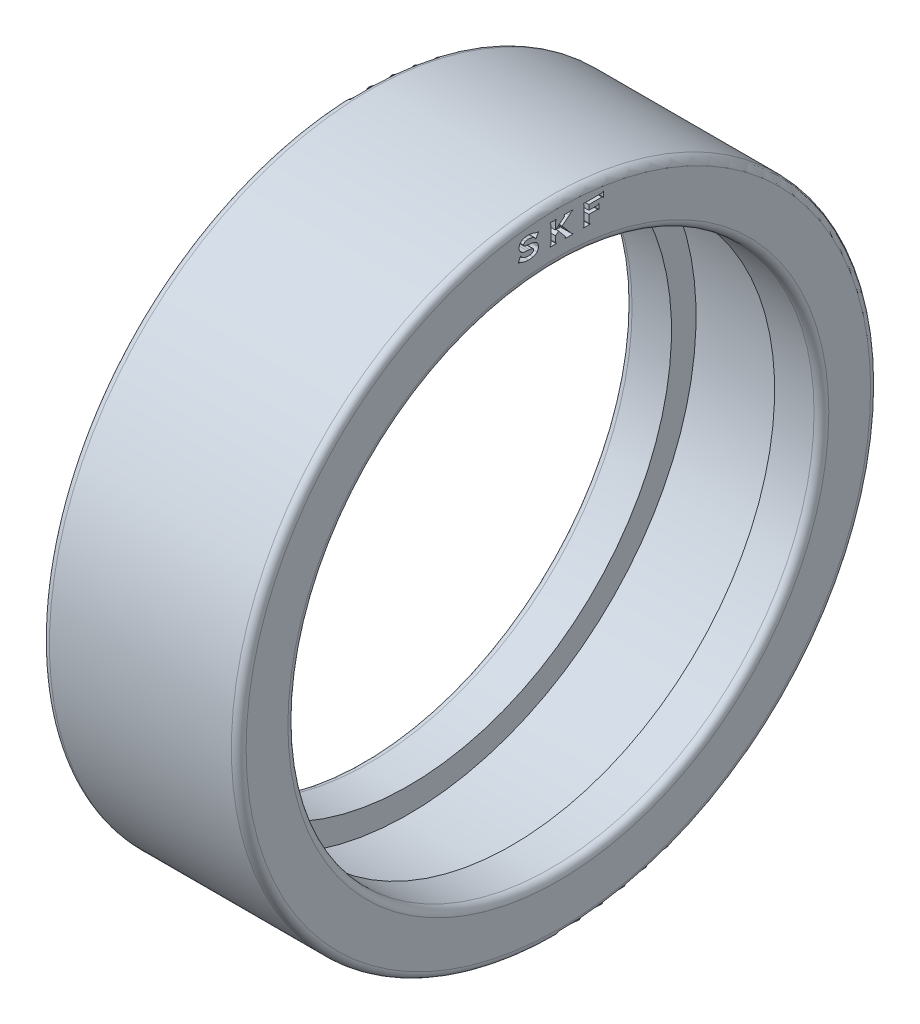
from build123d import *

# Parameters (mm, degrees)
CONG_1_R                = 0.3
ENL_V_MAT_EXTRU_1_DEPTH = 0.5
ENL_V_MAT_EXTRU_2_DEPTH = 0.5


with BuildPart() as part:
    # Esquisse1 → Base-R_volution (revolve)
    with BuildSketch(Plane.XY, mode=Mode.PRIVATE) as base_r_volution_sk:
        Polygon((0, 13), (8, 13), (8, 10.7), (6.097617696, 10.7), (6.097617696, 11.699280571), (1.902382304, 11.699280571), (1.902382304, 10.7), (0, 10.7), align=None)
    revolve(base_r_volution_sk.sketch.rotate(Axis((-1.3, 0, 0), (1, 0, 0)), 270), axis=Axis((-1.3, 0, 0), (1, 0, 0)))

    # Cong_1
    cong_1_edges = [part.edges().sort_by_distance(p)[0] for p in [
        (0, 0, 13),
        (8, 0, 13),
        (8, 0, 10.7),
        (0, 0, 10.7),
    ]]
    fillet(cong_1_edges, radius=CONG_1_R)

    # Esquisse2 → Enl_v. mat.-Extru.1 (cut)
    with BuildSketch(Plane.ZY):
        with BuildLine():
            Line((-0.854784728, 12.276830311), (-0.958073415, 12.074196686))
            Line((-0.958073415, 12.074196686), (-0.975726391, 12.084337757))
            add(Edge.make_bspline(
                [(-0.975726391, 12.084337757), (-0.975589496, 12.086277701), (-0.975351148, 12.089655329), (-0.975219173, 12.0930387), (-0.975162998, 12.094478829)],
                knots=[0, 0, 0, 0, 1.148701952, 2, 2, 2, 2], degree=3))
            add(Edge.make_bspline(
                [(-0.975162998, 12.094478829), (-0.975644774, 12.098268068), (-0.976690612, 12.106493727), (-0.98480233, 12.117973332), (-0.99638937, 12.129902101), (-1.006432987, 12.13696832), (-1.01197133, 12.140864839)],
                knots=[0, 0, 0, 0, 0.73831218, 1.60272366, 2.678072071, 4, 4, 4, 4], degree=3))
            add(Edge.make_bspline(
                [(-1.01197133, 12.140864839), (-1.021447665, 12.147165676), (-1.040373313, 12.159749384), (-1.070604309, 12.175655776), (-1.101961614, 12.189131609), (-1.134483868, 12.200426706), (-1.168354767, 12.208669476), (-1.203389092, 12.21501772), (-1.239698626, 12.218520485), (-1.264301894, 12.219080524), (-1.276765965, 12.219364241)],
                knots=[0, 0, 0, 0, 0.972885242, 1.942996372, 2.916765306, 3.890416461, 4.883889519, 5.895380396, 6.933794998, 8, 8, 8, 8], degree=3))
            add(Edge.make_bspline(
                [(-1.276765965, 12.219364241), (-1.287106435, 12.219236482), (-1.307214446, 12.218988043), (-1.336369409, 12.215558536), (-1.363812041, 12.210845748), (-1.381039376, 12.205463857), (-1.389444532, 12.202838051)],
                knots=[0, 0, 0, 0, 1.084209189, 2.108346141, 3.077068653, 4, 4, 4, 4], degree=3))
            add(Edge.make_bspline(
                [(-1.389444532, 12.202838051), (-1.39513336, 12.200582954), (-1.406297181, 12.196157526), (-1.421802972, 12.18753659), (-1.435436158, 12.177067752), (-1.447205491, 12.16534533), (-1.456928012, 12.152590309), (-1.463927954, 12.139005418), (-1.468388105, 12.124740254), (-1.468842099, 12.114980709), (-1.46907072, 12.11006603)],
                knots=[0, 0, 0, 0, 1.127971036, 2.213543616, 3.259654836, 4.288353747, 5.269766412, 6.204424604, 7.095790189, 8, 8, 8, 8], degree=3))
            add(Edge.make_bspline(
                [(-1.46907072, 12.11006603), (-1.468879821, 12.106170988), (-1.468505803, 12.098539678), (-1.46588921, 12.087557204), (-1.461334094, 12.077567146), (-1.454687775, 12.068744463), (-1.446345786, 12.060863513), (-1.436264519, 12.05381967), (-1.424295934, 12.04805032), (-1.415584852, 12.045116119), (-1.411041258, 12.043585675)],
                knots=[0, 0, 0, 0, 0.978451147, 1.917017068, 2.81791731, 3.717718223, 4.674561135, 5.691334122, 6.795827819, 8, 8, 8, 8], degree=3))
            add(Edge.make_bspline(
                [(-1.411041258, 12.043585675), (-1.408231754, 12.042804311), (-1.401908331, 12.041045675), (-1.391170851, 12.038876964), (-1.378247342, 12.036719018), (-1.363257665, 12.03415854), (-1.346125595, 12.032063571), (-1.326913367, 12.029587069), (-1.30552739, 12.026869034), (-1.290479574, 12.025392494), (-1.282587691, 12.024618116)],
                knots=[0, 0, 0, 0, 0.538375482, 1.211735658, 2.021344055, 2.958269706, 4.019330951, 5.207982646, 6.535715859, 8, 8, 8, 8], degree=3))
            Line((-1.282587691, 12.024618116), (-1.184745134, 12.014477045))
            add(Edge.make_bspline(
                [(-1.184745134, 12.014477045), (-1.170897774, 12.012888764), (-1.144453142, 12.009855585), (-1.107024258, 12.003952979), (-1.073764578, 11.99696577), (-1.044162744, 11.989314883), (-1.017378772, 11.980225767), (-0.992692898, 11.96932729), (-0.969197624, 11.957389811), (-0.954848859, 11.947590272), (-0.947744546, 11.942738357)],
                knots=[0, 0, 0, 0, 1.335664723, 2.55075067, 3.629676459, 4.591521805, 5.479392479, 6.336449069, 7.176348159, 8, 8, 8, 8], degree=3))
            add(Edge.make_bspline(
                [(-0.947744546, 11.942738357), (-0.940895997, 11.937335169), (-0.927224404, 11.926548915), (-0.909265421, 11.907193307), (-0.893395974, 11.885572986), (-0.880252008, 11.86156137), (-0.869488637, 11.836101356), (-0.861813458, 11.809438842), (-0.856897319, 11.781914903), (-0.856366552, 11.763224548), (-0.856099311, 11.753813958)],
                knots=[0, 0, 0, 0, 0.96044967, 1.917322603, 2.90009847, 3.910212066, 4.927841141, 5.941179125, 6.963384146, 8, 8, 8, 8], degree=3))
            add(Edge.make_bspline(
                [(-0.856099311, 11.753813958), (-0.856272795, 11.746355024), (-0.856616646, 11.731571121), (-0.859569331, 11.709782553), (-0.864033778, 11.688589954), (-0.870416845, 11.667990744), (-0.878931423, 11.648121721), (-0.889177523, 11.628888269), (-0.900955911, 11.610069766), (-0.910313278, 11.598416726), (-0.915067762, 11.592495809)],
                knots=[0, 0, 0, 0, 1.020260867, 2.022197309, 3.003376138, 3.981446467, 4.967883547, 5.956512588, 6.961702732, 8, 8, 8, 8], degree=3))
            add(Edge.make_bspline(
                [(-0.915067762, 11.592495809), (-0.919726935, 11.587205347), (-0.929134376, 11.576523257), (-0.945282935, 11.562029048), (-0.963252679, 11.548671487), (-0.983054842, 11.536281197), (-1.004682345, 11.524805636), (-1.028238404, 11.514505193), (-1.053616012, 11.505331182), (-1.071285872, 11.500131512), (-1.080329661, 11.497470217)],
                knots=[0, 0, 0, 0, 0.873425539, 1.763553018, 2.684020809, 3.646553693, 4.656868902, 5.716763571, 6.831393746, 8, 8, 8, 8], degree=3))
            add(Edge.make_bspline(
                [(-1.080329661, 11.497470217), (-1.094495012, 11.493882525), (-1.12312195, 11.486632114), (-1.167335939, 11.47949389), (-1.213010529, 11.47505076), (-1.243953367, 11.474475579), (-1.259676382, 11.474183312)],
                knots=[0, 0, 0, 0, 0.966421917, 1.95305437, 2.959883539, 4, 4, 4, 4], degree=3))
            add(Edge.make_bspline(
                [(-1.259676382, 11.474183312), (-1.273957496, 11.474448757), (-1.30256781, 11.47498054), (-1.345323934, 11.47889765), (-1.388012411, 11.484955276), (-1.430433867, 11.494226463), (-1.472908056, 11.505284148), (-1.515069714, 11.519427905), (-1.557246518, 11.535579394), (-1.584764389, 11.548444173), (-1.598651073, 11.554936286)],
                knots=[0, 0, 0, 0, 0.975201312, 1.953686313, 2.930123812, 3.917867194, 4.917529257, 5.926074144, 6.953409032, 8, 8, 8, 8], degree=3))
            add(Edge.make_bspline(
                [(-1.598651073, 11.554936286), (-1.603954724, 11.557361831), (-1.613320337, 11.561645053), (-1.625724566, 11.566651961), (-1.634484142, 11.570091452), (-1.639328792, 11.570821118), (-1.641093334, 11.571086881)],
                knots=[0, 0, 0, 0, 1.535740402, 2.711933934, 3.530854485, 4, 4, 4, 4], degree=3))
            add(Edge.make_bspline(
                [(-1.641093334, 11.571086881), (-1.642683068, 11.570922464), (-1.646408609, 11.570537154), (-1.65218156, 11.567401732), (-1.659417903, 11.563421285), (-1.664304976, 11.559651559), (-1.667009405, 11.557565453)],
                knots=[0, 0, 0, 0, 0.642394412, 1.505451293, 2.61955663, 4, 4, 4, 4], degree=3))
            Line((-1.667009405, 11.557565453), (-1.685413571, 11.566767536))
            Line((-1.685413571, 11.566767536), (-1.593017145, 11.778227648))
            Line((-1.593017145, 11.778227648), (-1.574800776, 11.769213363))
            add(Edge.make_bspline(
                [(-1.574800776, 11.769213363), (-1.574800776, 11.767585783), (-1.574800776, 11.764831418), (-1.574800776, 11.762077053), (-1.574800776, 11.760950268)],
                knots=[0, 0, 0, 0, 1.181818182, 2, 2, 2, 2], degree=3))
            add(Edge.make_bspline(
                [(-1.574800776, 11.760950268), (-1.574481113, 11.756266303), (-1.573835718, 11.746809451), (-1.568238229, 11.733185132), (-1.559924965, 11.719875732), (-1.552080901, 11.712339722), (-1.547945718, 11.708366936)],
                knots=[0, 0, 0, 0, 0.921499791, 1.860494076, 2.872108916, 4, 4, 4, 4], degree=3))
            add(Edge.make_bspline(
                [(-1.547945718, 11.708366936), (-1.54436343, 11.705300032), (-1.536992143, 11.698989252), (-1.524627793, 11.69044168), (-1.511110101, 11.681898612), (-1.496065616, 11.673905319), (-1.479618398, 11.666200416), (-1.461839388, 11.658709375), (-1.442659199, 11.651589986), (-1.415588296, 11.642707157), (-1.381297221, 11.633024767), (-1.340351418, 11.624866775), (-1.300512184, 11.619411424), (-1.274278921, 11.618741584), (-1.26136656, 11.618411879)],
                knots=[0, 0, 0, 0, 0.555510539, 1.143075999, 1.769567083, 2.439726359, 3.149382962, 3.909957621, 4.713113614, 5.560117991, 7.267970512, 8.908954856, 10.478546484, 12, 12, 12, 12], degree=3))
            add(Edge.make_bspline(
                [(-1.26136656, 11.618411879), (-1.248011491, 11.618690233), (-1.222191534, 11.619228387), (-1.185082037, 11.624646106), (-1.150800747, 11.632982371), (-1.129816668, 11.641743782), (-1.119579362, 11.646018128)],
                knots=[0, 0, 0, 0, 1.100432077, 2.127514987, 3.086488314, 4, 4, 4, 4], degree=3))
            add(Edge.make_bspline(
                [(-1.119579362, 11.646018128), (-1.114369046, 11.64864114), (-1.104094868, 11.653813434), (-1.09034306, 11.663649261), (-1.077989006, 11.67448459), (-1.067618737, 11.686589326), (-1.059107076, 11.69942939), (-1.053077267, 11.712752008), (-1.048950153, 11.726274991), (-1.048585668, 11.735505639), (-1.048404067, 11.740104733)],
                knots=[0, 0, 0, 0, 1.125677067, 2.219712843, 3.256407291, 4.294230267, 5.290694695, 6.221721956, 7.113987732, 8, 8, 8, 8], degree=3))
            add(Edge.make_bspline(
                [(-1.048404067, 11.740104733), (-1.048560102, 11.743493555), (-1.048863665, 11.750086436), (-1.050876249, 11.759595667), (-1.054618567, 11.768213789), (-1.059488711, 11.776233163), (-1.066022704, 11.783429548), (-1.073943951, 11.789818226), (-1.083326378, 11.795263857), (-1.090125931, 11.798263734), (-1.093663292, 11.799824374)],
                knots=[0, 0, 0, 0, 1.013783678, 1.972294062, 2.886825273, 3.811647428, 4.766310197, 5.778017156, 6.844048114, 8, 8, 8, 8], degree=3))
            add(Edge.make_bspline(
                [(-1.093663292, 11.799824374), (-1.096594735, 11.800858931), (-1.103078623, 11.803147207), (-1.113990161, 11.806111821), (-1.12701383, 11.808785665), (-1.141937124, 11.811875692), (-1.158916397, 11.814668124), (-1.177921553, 11.817164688), (-1.198861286, 11.820107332), (-1.213535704, 11.821712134), (-1.221177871, 11.822547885)],
                knots=[0, 0, 0, 0, 0.5747891, 1.27134239, 2.088820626, 3.033330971, 4.089642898, 5.270110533, 6.578323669, 8, 8, 8, 8], degree=3))
            Line((-1.221177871, 11.822547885), (-1.316579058, 11.832313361))
            add(Edge.make_bspline(
                [(-1.316579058, 11.832313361), (-1.324282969, 11.83309031), (-1.339140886, 11.83458875), (-1.360521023, 11.837345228), (-1.38019555, 11.839700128), (-1.39804444, 11.842106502), (-1.41410291, 11.844677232), (-1.428496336, 11.846722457), (-1.441039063, 11.849280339), (-1.462343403, 11.85360191), (-1.492967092, 11.86318592), (-1.518534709, 11.875314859), (-1.531607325, 11.881516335)],
                knots=[0, 0, 0, 0, 1.046031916, 2.017397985, 2.912186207, 3.723109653, 4.450332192, 5.109398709, 5.686600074, 6.179228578, 8.046455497, 10, 10, 10, 10], degree=3))
            add(Edge.make_bspline(
                [(-1.531607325, 11.881516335), (-1.540683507, 11.886622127), (-1.5587267, 11.896772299), (-1.582499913, 11.91696727), (-1.603575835, 11.940375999), (-1.614631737, 11.95838143), (-1.620247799, 11.967527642)],
                knots=[0, 0, 0, 0, 0.995701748, 1.979427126, 2.973610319, 4, 4, 4, 4], degree=3))
            add(Edge.make_bspline(
                [(-1.620247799, 11.967527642), (-1.624781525, 11.976363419), (-1.633906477, 11.99414703), (-1.642657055, 12.023309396), (-1.648320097, 12.054130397), (-1.649005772, 12.075359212), (-1.649356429, 12.086215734)],
                knots=[0, 0, 0, 0, 0.963245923, 1.938708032, 2.945845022, 4, 4, 4, 4], degree=3))
            add(Edge.make_bspline(
                [(-1.649356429, 12.086215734), (-1.649168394, 12.095243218), (-1.648799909, 12.112934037), (-1.645065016, 12.138832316), (-1.63930931, 12.163499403), (-1.631211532, 12.187016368), (-1.620593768, 12.209254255), (-1.60775391, 12.230429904), (-1.59256414, 12.250444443), (-1.580757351, 12.262490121), (-1.574800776, 12.268567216)],
                knots=[0, 0, 0, 0, 1.068408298, 2.093719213, 3.091651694, 4.064572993, 5.032823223, 6.004133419, 6.993076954, 8, 8, 8, 8], degree=3))
            add(Edge.make_bspline(
                [(-1.574800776, 12.268567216), (-1.566362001, 12.27626994), (-1.549330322, 12.291816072), (-1.5197433, 12.310729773), (-1.487591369, 12.327255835), (-1.452344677, 12.340764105), (-1.413935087, 12.351040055), (-1.372567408, 12.358162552), (-1.328203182, 12.362824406), (-1.297624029, 12.363331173), (-1.2818365, 12.363592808)],
                knots=[0, 0, 0, 0, 0.867095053, 1.750026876, 2.658740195, 3.61224737, 4.613037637, 5.676217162, 6.800268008, 8, 8, 8, 8], degree=3))
            add(Edge.make_bspline(
                [(-1.2818365, 12.363592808), (-1.268244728, 12.363455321), (-1.241460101, 12.363184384), (-1.202047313, 12.359765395), (-1.16400066, 12.354924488), (-1.13315771, 12.348584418), (-1.108364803, 12.342525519), (-1.088747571, 12.337123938), (-1.068075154, 12.330627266), (-1.046243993, 12.32355618), (-1.023382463, 12.315389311), (-0.999346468, 12.306655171), (-0.974277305, 12.296790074), (-0.957250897, 12.289809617), (-0.948495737, 12.286220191)],
                knots=[0, 0, 0, 0, 1.418580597, 2.795525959, 4.127438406, 5.420692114, 6.080098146, 6.792018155, 7.544481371, 8.342241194, 9.187648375, 10.078804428, 11.012100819, 12, 12, 12, 12], degree=3))
            add(Edge.make_bspline(
                [(-0.948495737, 12.286220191), (-0.942936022, 12.284057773), (-0.933113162, 12.280237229), (-0.920061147, 12.275635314), (-0.910601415, 12.272778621), (-0.905372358, 12.272036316), (-0.90342431, 12.271759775)],
                knots=[0, 0, 0, 0, 1.508590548, 2.66536534, 3.502791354, 4, 4, 4, 4], degree=3))
            add(Edge.make_bspline(
                [(-0.90342431, 12.271759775), (-0.901086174, 12.271970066), (-0.896153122, 12.272413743), (-0.888612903, 12.275363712), (-0.880519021, 12.279897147), (-0.875262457, 12.284010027), (-0.872437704, 12.286220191)],
                knots=[0, 0, 0, 0, 0.806318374, 1.701189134, 2.764673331, 4, 4, 4, 4], degree=3))
            Line((-0.872437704, 12.286220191), (-0.854784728, 12.276830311))
        make_face()
        with BuildLine():
            Line((-0.032231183, 11.887901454), (-0.158994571, 11.786115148))
            Line((-0.158994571, 11.786115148), (-0.158994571, 11.556063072))
            add(Edge.make_bspline(
                [(-0.158994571, 11.556063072), (-0.158892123, 11.552987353), (-0.15870045, 11.547232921), (-0.157147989, 11.539146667), (-0.154805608, 11.532085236), (-0.151137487, 11.525989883), (-0.145984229, 11.521038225), (-0.139700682, 11.51661496), (-0.131794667, 11.513141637), (-0.126022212, 11.511250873), (-0.12293743, 11.510240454)],
                knots=[0, 0, 0, 0, 1.150123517, 2.151792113, 3.070577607, 3.922405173, 4.783843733, 5.726221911, 6.784899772, 8, 8, 8, 8], degree=3))
            Line((-0.12293743, 11.510240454), (-0.12293743, 11.48620236))
            Line((-0.12293743, 11.48620236), (-0.387356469, 11.48620236))
            Line((-0.387356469, 11.48620236), (-0.387356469, 11.510240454))
            add(Edge.make_bspline(
                [(-0.387356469, 11.510240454), (-0.384207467, 11.511311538), (-0.378301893, 11.513320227), (-0.370294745, 11.516964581), (-0.364013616, 11.521360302), (-0.358938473, 11.526169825), (-0.355534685, 11.532219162), (-0.352835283, 11.539077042), (-0.35168723, 11.547265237), (-0.35143461, 11.552994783), (-0.351299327, 11.556063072)],
                knots=[0, 0, 0, 0, 1.245049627, 2.334940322, 3.277358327, 4.105699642, 4.925380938, 5.852235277, 6.849827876, 8, 8, 8, 8], degree=3))
            Line((-0.351299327, 11.556063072), (-0.351299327, 12.282276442))
            add(Edge.make_bspline(
                [(-0.351299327, 12.282276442), (-0.351433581, 12.285282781), (-0.351683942, 12.290889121), (-0.352841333, 12.298886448), (-0.355512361, 12.305584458), (-0.359058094, 12.311446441), (-0.363932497, 12.316430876), (-0.370309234, 12.320798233), (-0.378297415, 12.324460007), (-0.384205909, 12.326466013), (-0.387356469, 12.327535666)],
                knots=[0, 0, 0, 0, 1.136968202, 2.120262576, 3.033418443, 3.84032541, 4.69303108, 5.643963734, 6.743701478, 8, 8, 8, 8], degree=3))
            Line((-0.387356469, 12.327535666), (-0.387356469, 12.351573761))
            Line((-0.387356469, 12.351573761), (-0.12293743, 12.351573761))
            Line((-0.12293743, 12.351573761), (-0.12293743, 12.327535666))
            add(Edge.make_bspline(
                [(-0.12293743, 12.327535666), (-0.12609114, 12.326537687), (-0.131943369, 12.324685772), (-0.139898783, 12.321087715), (-0.146335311, 12.316860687), (-0.15128457, 12.311790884), (-0.154735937, 12.305888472), (-0.157198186, 12.299152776), (-0.158678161, 12.29135346), (-0.158884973, 12.285788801), (-0.158994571, 12.282839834)],
                knots=[0, 0, 0, 0, 1.256251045, 2.331180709, 3.307635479, 4.165642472, 4.997871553, 5.88601592, 6.879703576, 8, 8, 8, 8], degree=3))
            Line((-0.158994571, 12.282839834), (-0.158994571, 11.986307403))
            Line((-0.158994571, 11.986307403), (0.195942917, 12.270445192))
            add(Edge.make_bspline(
                [(0.195942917, 12.270445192), (0.199661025, 12.273555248), (0.20630982, 12.279116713), (0.214105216, 12.287639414), (0.219507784, 12.295065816), (0.220366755, 12.300190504), (0.220732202, 12.302370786)],
                knots=[0, 0, 0, 0, 1.402912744, 2.508716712, 3.365538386, 4, 4, 4, 4], degree=3))
            add(Edge.make_bspline(
                [(0.220732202, 12.302370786), (0.220280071, 12.305339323), (0.219319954, 12.311643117), (0.210873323, 12.31881991), (0.199046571, 12.32435206), (0.189391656, 12.326384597), (0.18392387, 12.327535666)],
                knots=[0, 0, 0, 0, 0.728704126, 1.547429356, 2.61105656, 4, 4, 4, 4], degree=3))
            Line((0.18392387, 12.327535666), (0.18392387, 12.351573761))
            Line((0.18392387, 12.351573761), (0.538110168, 12.351573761))
            Line((0.538110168, 12.351573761), (0.538110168, 12.327535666))
            add(Edge.make_bspline(
                [(0.538110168, 12.327535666), (0.534656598, 12.326829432), (0.528270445, 12.325523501), (0.519551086, 12.323068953), (0.51235456, 12.320509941), (0.507129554, 12.317919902), (0.502978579, 12.315315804), (0.498957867, 12.312361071), (0.493788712, 12.308526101), (0.487567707, 12.303511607), (0.48005917, 12.297766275), (0.471453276, 12.291042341), (0.461789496, 12.283230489), (0.454977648, 12.277707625), (0.451347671, 12.274764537)],
                knots=[0, 0, 0, 0, 1.230627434, 2.275608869, 3.160902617, 3.894135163, 4.306603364, 4.870763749, 5.635890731, 6.554303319, 7.660596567, 8.937535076, 10.368038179, 12, 12, 12, 12], degree=3))
            Line((0.451347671, 12.274764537), (0.402520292, 12.234575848))
            Line((0.402520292, 12.234575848), (0.108617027, 12.000392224))
            Line((0.108617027, 12.000392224), (0.443460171, 11.60263688))
            add(Edge.make_bspline(
                [(0.443460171, 11.60263688), (0.447213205, 11.598064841), (0.454378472, 11.589335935), (0.464686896, 11.576869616), (0.474332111, 11.56578314), (0.483021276, 11.555885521), (0.491016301, 11.547346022), (0.498149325, 11.540015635), (0.504395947, 11.533855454), (0.511804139, 11.527384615), (0.52136128, 11.521055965), (0.533705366, 11.514688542), (0.547477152, 11.510076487), (0.557178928, 11.508073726), (0.562148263, 11.507047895)],
                knots=[0, 0, 0, 0, 1.360803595, 2.598037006, 3.721133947, 4.74127298, 5.627727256, 6.411890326, 7.094232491, 7.645625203, 8.672148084, 9.721943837, 10.83315975, 12, 12, 12, 12], degree=3))
            Line((0.562148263, 11.507047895), (0.562148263, 11.48620236))
            Line((0.562148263, 11.48620236), (0.222985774, 11.48620236))
            Line((0.222985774, 11.48620236), (0.222985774, 11.510240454))
            add(Edge.make_bspline(
                [(0.222985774, 11.510240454), (0.228001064, 11.511433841), (0.236845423, 11.513538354), (0.247801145, 11.518646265), (0.255492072, 11.525459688), (0.25637407, 11.53132783), (0.256789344, 11.534090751)],
                knots=[0, 0, 0, 0, 1.385073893, 2.44254822, 3.266698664, 4, 4, 4, 4], degree=3))
            add(Edge.make_bspline(
                [(0.256789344, 11.534090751), (0.256246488, 11.53619149), (0.254736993, 11.542032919), (0.248164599, 11.551649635), (0.238608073, 11.565061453), (0.230686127, 11.575005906), (0.226178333, 11.580664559)],
                knots=[0, 0, 0, 0, 0.461725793, 1.283900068, 2.454468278, 4, 4, 4, 4], degree=3))
            Line((0.226178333, 11.580664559), (-0.032231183, 11.887901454))
        make_face()
        with BuildLine():
            Line((1.211176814, 11.858792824), (1.211176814, 11.555311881))
            add(Edge.make_bspline(
                [(1.211176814, 11.555311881), (1.211284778, 11.55229967), (1.211488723, 11.546609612), (1.21299325, 11.538635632), (1.215369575, 11.531702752), (1.21903711, 11.525782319), (1.22425262, 11.521045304), (1.230461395, 11.516604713), (1.23837958, 11.513144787), (1.244150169, 11.51125197), (1.247233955, 11.510240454)],
                knots=[0, 0, 0, 0, 1.138371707, 2.150380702, 3.056353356, 3.89688452, 4.750642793, 5.702749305, 6.772356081, 8, 8, 8, 8], degree=3))
            Line((1.247233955, 11.510240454), (1.247233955, 11.48620236))
            Line((1.247233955, 11.48620236), (0.982814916, 11.48620236))
            Line((0.982814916, 11.48620236), (0.982814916, 11.510240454))
            add(Edge.make_bspline(
                [(0.982814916, 11.510240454), (0.985963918, 11.511311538), (0.991869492, 11.513320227), (0.99987664, 11.516964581), (1.006157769, 11.521360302), (1.011232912, 11.526169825), (1.014636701, 11.532219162), (1.017336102, 11.539077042), (1.018484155, 11.547265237), (1.018736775, 11.552994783), (1.018872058, 11.556063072)],
                knots=[0, 0, 0, 0, 1.245049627, 2.334940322, 3.277358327, 4.105699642, 4.925380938, 5.852235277, 6.849827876, 8, 8, 8, 8], degree=3))
            Line((1.018872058, 11.556063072), (1.018872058, 12.281713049))
            add(Edge.make_bspline(
                [(1.018872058, 12.281713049), (1.01873399, 12.284780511), (1.018476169, 12.290508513), (1.017370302, 12.298648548), (1.01460079, 12.305424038), (1.011179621, 12.311424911), (1.006230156, 12.316425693), (0.999865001, 12.320799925), (0.991873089, 12.324459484), (0.985965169, 12.326465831), (0.982814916, 12.327535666)],
                knots=[0, 0, 0, 0, 1.150912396, 2.149147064, 3.054708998, 3.874917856, 4.720532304, 5.663556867, 6.754149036, 8, 8, 8, 8], degree=3))
            Line((0.982814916, 12.327535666), (0.982814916, 12.351573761))
            Line((0.982814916, 12.351573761), (1.742831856, 12.351573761))
            add(Edge.make_bspline(
                [(1.742831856, 12.351573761), (1.745775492, 12.351713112), (1.75138048, 12.351978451), (1.759296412, 12.353100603), (1.766065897, 12.355659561), (1.771970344, 12.359092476), (1.777044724, 12.364044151), (1.781293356, 12.370561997), (1.785027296, 12.378564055), (1.787025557, 12.384477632), (1.788091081, 12.387630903)],
                knots=[0, 0, 0, 0, 1.112138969, 2.117627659, 2.99930499, 3.825474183, 4.677233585, 5.646578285, 6.745095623, 8, 8, 8, 8], degree=3))
            Line((1.788091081, 12.387630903), (1.812129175, 12.387630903))
            Line((1.812129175, 12.387630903), (1.812129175, 12.171288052))
            Line((1.812129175, 12.171288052), (1.788091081, 12.171288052))
            add(Edge.make_bspline(
                [(1.788091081, 12.171288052), (1.787028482, 12.174503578), (1.785051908, 12.180484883), (1.781352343, 12.188524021), (1.776982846, 12.194894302), (1.771976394, 12.199830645), (1.766064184, 12.203258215), (1.759296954, 12.205818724), (1.75138032, 12.206940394), (1.745775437, 12.207205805), (1.742831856, 12.207345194)],
                knots=[0, 0, 0, 0, 1.276704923, 2.374841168, 3.324389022, 4.175852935, 5.001735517, 5.88310698, 6.88824685, 8, 8, 8, 8], degree=3))
            Line((1.742831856, 12.207345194), (1.211176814, 12.207345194))
            Line((1.211176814, 12.207345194), (1.211176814, 12.003021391))
            Line((1.211176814, 12.003021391), (1.56160716, 12.003021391))
            add(Edge.make_bspline(
                [(1.56160716, 12.003021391), (1.564681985, 12.003130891), (1.570496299, 12.00333795), (1.578594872, 12.004816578), (1.585613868, 12.007194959), (1.591434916, 12.010954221), (1.596596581, 12.015841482), (1.600734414, 12.022400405), (1.604804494, 12.030131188), (1.606764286, 12.035974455), (1.607805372, 12.039078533)],
                knots=[0, 0, 0, 0, 1.148343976, 2.171450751, 3.066779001, 3.897434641, 4.741161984, 5.701365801, 6.77891266, 8, 8, 8, 8], degree=3))
            Line((1.607805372, 12.039078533), (1.631843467, 12.039078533))
            Line((1.631843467, 12.039078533), (1.631843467, 11.822735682))
            Line((1.631843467, 11.822735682), (1.607805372, 11.822735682))
            add(Edge.make_bspline(
                [(1.607805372, 11.822735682), (1.606749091, 11.825831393), (1.604742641, 11.831711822), (1.600849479, 11.839546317), (1.596529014, 11.845989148), (1.591442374, 11.85086484), (1.58561172, 11.85461786), (1.578595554, 11.856998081), (1.570496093, 11.858476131), (1.564681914, 11.858683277), (1.56160716, 11.858792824)],
                knots=[0, 0, 0, 0, 1.220845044, 2.31904542, 3.25977879, 4.103338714, 4.933829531, 5.828980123, 6.851883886, 8, 8, 8, 8], degree=3))
            Line((1.56160716, 11.858792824), (1.211176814, 11.858792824))
        make_face()
    extrude(amount=-ENL_V_MAT_EXTRU_1_DEPTH, mode=Mode.SUBTRACT)

    # Esquisse3 → Enl_v. mat.-Extru.2 (cut)
    with BuildSketch(Plane(origin=(8, 0, 0), x_dir=(0, 0, -1), z_dir=(1, 0, 0))):
        with BuildLine():
            Line((-0.808351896, 12.27617113), (-0.910837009, 12.075113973))
            Line((-0.910837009, 12.075113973), (-0.928352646, 12.085176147))
            add(Edge.make_bspline(
                [(-0.928352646, 12.085176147), (-0.928216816, 12.087100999), (-0.927980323, 12.090452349), (-0.927849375, 12.093809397), (-0.927793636, 12.095238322)],
                knots=[0, 0, 0, 0, 1.148701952, 2, 2, 2, 2], degree=3))
            add(Edge.make_bspline(
                [(-0.927793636, 12.095238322), (-0.928271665, 12.098998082), (-0.929309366, 12.107159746), (-0.937357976, 12.118550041), (-0.94885487, 12.130386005), (-0.958820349, 12.13739725), (-0.964315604, 12.141263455)],
                knots=[0, 0, 0, 0, 0.73831218, 1.60272366, 2.678072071, 4, 4, 4, 4], degree=3))
            add(Edge.make_bspline(
                [(-0.964315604, 12.141263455), (-0.973718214, 12.147515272), (-0.992496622, 12.16000108), (-1.022492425, 12.175783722), (-1.053605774, 12.189154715), (-1.085875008, 12.200361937), (-1.119482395, 12.208540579), (-1.154244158, 12.214839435), (-1.190271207, 12.218314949), (-1.214683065, 12.218870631), (-1.227050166, 12.21915214)],
                knots=[0, 0, 0, 0, 0.972885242, 1.942996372, 2.916765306, 3.890416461, 4.883889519, 5.895380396, 6.933794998, 8, 8, 8, 8], degree=3))
            add(Edge.make_bspline(
                [(-1.227050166, 12.21915214), (-1.237310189, 12.219025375), (-1.257261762, 12.218778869), (-1.286189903, 12.215376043), (-1.313419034, 12.21069992), (-1.330512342, 12.2053599), (-1.338852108, 12.202754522)],
                knots=[0, 0, 0, 0, 1.084209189, 2.108346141, 3.077068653, 4, 4, 4, 4], degree=3))
            add(Edge.make_bspline(
                [(-1.338852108, 12.202754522), (-1.344496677, 12.20051697), (-1.355573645, 12.196125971), (-1.370958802, 12.187572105), (-1.384485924, 12.177184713), (-1.396163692, 12.165553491), (-1.405810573, 12.152897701), (-1.412756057, 12.1394185), (-1.417181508, 12.125264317), (-1.417631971, 12.1155807), (-1.417858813, 12.110704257)],
                knots=[0, 0, 0, 0, 1.127971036, 2.213543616, 3.259654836, 4.288353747, 5.269766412, 6.204424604, 7.095790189, 8, 8, 8, 8], degree=3))
            add(Edge.make_bspline(
                [(-1.417858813, 12.110704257), (-1.417669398, 12.106839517), (-1.417298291, 12.099267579), (-1.414702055, 12.088370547), (-1.410182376, 12.07845821), (-1.403587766, 12.069704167), (-1.395310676, 12.06188453), (-1.38530784, 12.054895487), (-1.373432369, 12.049171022), (-1.364789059, 12.046259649), (-1.360280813, 12.044741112)],
                knots=[0, 0, 0, 0, 0.978451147, 1.917017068, 2.81791731, 3.717718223, 4.674561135, 5.691334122, 6.795827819, 8, 8, 8, 8], degree=3))
            add(Edge.make_bspline(
                [(-1.360280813, 12.044741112), (-1.357493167, 12.043965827), (-1.351218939, 12.042220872), (-1.340564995, 12.040069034), (-1.327742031, 12.037927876), (-1.312868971, 12.035387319), (-1.295870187, 12.033308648), (-1.276807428, 12.030851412), (-1.255587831, 12.028154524), (-1.240657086, 12.026689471), (-1.2328266, 12.025921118)],
                knots=[0, 0, 0, 0, 0.538375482, 1.211735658, 2.021344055, 2.958269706, 4.019330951, 5.207982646, 6.535715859, 8, 8, 8, 8], degree=3))
            Line((-1.2328266, 12.025921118), (-1.135745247, 12.015858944))
            add(Edge.make_bspline(
                [(-1.135745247, 12.015858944), (-1.122005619, 12.014283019), (-1.095766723, 12.011273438), (-1.058629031, 12.005416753), (-1.025628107, 11.998483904), (-0.996256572, 11.99089254), (-0.969680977, 11.981874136), (-0.945187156, 11.971060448), (-0.921874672, 11.959215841), (-0.907637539, 11.949492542), (-0.900588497, 11.944678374)],
                knots=[0, 0, 0, 0, 1.335664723, 2.55075067, 3.629676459, 4.591521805, 5.479392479, 6.336449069, 7.176348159, 8, 8, 8, 8], degree=3))
            add(Edge.make_bspline(
                [(-0.900588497, 11.944678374), (-0.893793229, 11.939317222), (-0.880227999, 11.928614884), (-0.862408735, 11.909409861), (-0.846662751, 11.887957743), (-0.833621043, 11.864132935), (-0.82294141, 11.838870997), (-0.815325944, 11.812415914), (-0.810448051, 11.785106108), (-0.809921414, 11.766561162), (-0.809656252, 11.757223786)],
                knots=[0, 0, 0, 0, 0.96044967, 1.917322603, 2.90009847, 3.910212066, 4.927841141, 5.941179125, 6.963384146, 8, 8, 8, 8], degree=3))
            add(Edge.make_bspline(
                [(-0.809656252, 11.757223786), (-0.809828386, 11.749822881), (-0.810169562, 11.735153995), (-0.813099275, 11.71353494), (-0.817528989, 11.692507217), (-0.823862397, 11.672068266), (-0.832310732, 11.652353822), (-0.842477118, 11.633270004), (-0.854163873, 11.614597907), (-0.86344844, 11.603035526), (-0.868165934, 11.597160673)],
                knots=[0, 0, 0, 0, 1.020260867, 2.022197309, 3.003376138, 3.981446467, 4.967883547, 5.956512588, 6.961702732, 8, 8, 8, 8], degree=3))
            add(Edge.make_bspline(
                [(-0.868165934, 11.597160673), (-0.87278886, 11.59191137), (-0.882123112, 11.581312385), (-0.898146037, 11.56693094), (-0.915975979, 11.553677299), (-0.935624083, 11.541383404), (-0.957083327, 11.529997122), (-0.980456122, 11.519776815), (-1.005636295, 11.510674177), (-1.023168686, 11.50551496), (-1.032142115, 11.502874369)],
                knots=[0, 0, 0, 0, 0.873425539, 1.763553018, 2.684020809, 3.646553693, 4.656868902, 5.716763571, 6.831393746, 8, 8, 8, 8], degree=3))
            add(Edge.make_bspline(
                [(-1.032142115, 11.502874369), (-1.046197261, 11.49931459), (-1.074601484, 11.492120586), (-1.118471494, 11.485037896), (-1.163790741, 11.480629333), (-1.194492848, 11.480058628), (-1.210093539, 11.479768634)],
                knots=[0, 0, 0, 0, 0.966421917, 1.95305437, 2.959883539, 4, 4, 4, 4], degree=3))
            add(Edge.make_bspline(
                [(-1.210093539, 11.479768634), (-1.224263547, 11.480032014), (-1.252651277, 11.480559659), (-1.295074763, 11.484446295), (-1.337431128, 11.490456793), (-1.37952255, 11.499655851), (-1.421666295, 11.510627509), (-1.46349994, 11.524661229), (-1.505348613, 11.540687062), (-1.532652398, 11.553451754), (-1.546431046, 11.559893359)],
                knots=[0, 0, 0, 0, 0.975201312, 1.953686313, 2.930123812, 3.917867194, 4.917529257, 5.926074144, 6.953409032, 8, 8, 8, 8], degree=3))
            add(Edge.make_bspline(
                [(-1.546431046, 11.559893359), (-1.551693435, 11.562300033), (-1.560986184, 11.566549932), (-1.573293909, 11.571517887), (-1.581985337, 11.57493062), (-1.586792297, 11.575654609), (-1.58854311, 11.575918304)],
                knots=[0, 0, 0, 0, 1.535740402, 2.711933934, 3.530854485, 4, 4, 4, 4], degree=3))
            add(Edge.make_bspline(
                [(-1.58854311, 11.575918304), (-1.590120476, 11.575755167), (-1.593817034, 11.575372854), (-1.599545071, 11.572261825), (-1.606725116, 11.568312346), (-1.611574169, 11.564571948), (-1.614257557, 11.562502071)],
                knots=[0, 0, 0, 0, 0.642394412, 1.505451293, 2.61955663, 4, 4, 4, 4], degree=3))
            Line((-1.614257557, 11.562502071), (-1.632518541, 11.571632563))
            Line((-1.632518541, 11.571632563), (-1.540840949, 11.78144754))
            Line((-1.540840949, 11.78144754), (-1.522766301, 11.772503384))
            add(Edge.make_bspline(
                [(-1.522766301, 11.772503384), (-1.522766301, 11.770888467), (-1.522766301, 11.768155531), (-1.522766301, 11.765422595), (-1.522766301, 11.764304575)],
                knots=[0, 0, 0, 0, 1.181818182, 2, 2, 2, 2], degree=3))
            add(Edge.make_bspline(
                [(-1.522766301, 11.764304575), (-1.522449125, 11.759657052), (-1.521808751, 11.750273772), (-1.51625481, 11.736755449), (-1.508006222, 11.723549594), (-1.500223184, 11.716072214), (-1.496120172, 11.712130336)],
                knots=[0, 0, 0, 0, 0.921499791, 1.860494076, 2.872108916, 4, 4, 4, 4], degree=3))
            add(Edge.make_bspline(
                [(-1.496120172, 11.712130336), (-1.492565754, 11.709087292), (-1.485251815, 11.70282561), (-1.472983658, 11.694344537), (-1.459571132, 11.685867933), (-1.444643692, 11.677936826), (-1.428324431, 11.670291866), (-1.41068374, 11.662859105), (-1.39165277, 11.655795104), (-1.364792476, 11.646981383), (-1.330768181, 11.637374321), (-1.290140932, 11.629279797), (-1.250611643, 11.623866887), (-1.224582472, 11.623202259), (-1.211770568, 11.622875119)],
                knots=[0, 0, 0, 0, 0.555510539, 1.143075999, 1.769567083, 2.439726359, 3.149382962, 3.909957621, 4.713113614, 5.560117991, 7.267970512, 8.908954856, 10.478546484, 12, 12, 12, 12], degree=3))
            add(Edge.make_bspline(
                [(-1.211770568, 11.622875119), (-1.1985194, 11.623151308), (-1.172900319, 11.623685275), (-1.13607953, 11.629060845), (-1.102064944, 11.637332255), (-1.081244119, 11.646025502), (-1.071086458, 11.650266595)],
                knots=[0, 0, 0, 0, 1.100432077, 2.127514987, 3.086488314, 4, 4, 4, 4], degree=3))
            add(Edge.make_bspline(
                [(-1.071086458, 11.650266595), (-1.065916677, 11.6528692), (-1.055722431, 11.658001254), (-1.042077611, 11.667760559), (-1.029819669, 11.678511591), (-1.019530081, 11.690522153), (-1.011084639, 11.703262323), (-1.005101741, 11.716481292), (-1.001006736, 11.729899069), (-1.000645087, 11.739057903), (-1.000464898, 11.743621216)],
                knots=[0, 0, 0, 0, 1.125677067, 2.219712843, 3.256407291, 4.294230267, 5.290694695, 6.221721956, 7.113987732, 8, 8, 8, 8], degree=3))
            add(Edge.make_bspline(
                [(-1.000464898, 11.743621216), (-1.00061972, 11.746983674), (-1.000920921, 11.753525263), (-1.002917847, 11.762960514), (-1.00663105, 11.771511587), (-1.011463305, 11.779468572), (-1.017946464, 11.786608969), (-1.025806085, 11.792947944), (-1.035115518, 11.798351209), (-1.041862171, 11.801327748), (-1.045372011, 11.802876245)],
                knots=[0, 0, 0, 0, 1.013783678, 1.972294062, 2.886825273, 3.811647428, 4.766310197, 5.778017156, 6.844048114, 8, 8, 8, 8], degree=3))
            add(Edge.make_bspline(
                [(-1.045372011, 11.802876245), (-1.048280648, 11.803902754), (-1.054714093, 11.806173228), (-1.06554074, 11.809114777), (-1.078463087, 11.811767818), (-1.093270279, 11.814833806), (-1.110117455, 11.817604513), (-1.128974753, 11.820081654), (-1.149751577, 11.823001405), (-1.16431183, 11.824593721), (-1.171894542, 11.82542297)],
                knots=[0, 0, 0, 0, 0.5747891, 1.27134239, 2.088820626, 3.033330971, 4.089642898, 5.270110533, 6.578323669, 8, 8, 8, 8], degree=3))
            Line((-1.171894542, 11.82542297), (-1.266553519, 11.835112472))
            add(Edge.make_bspline(
                [(-1.266553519, 11.835112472), (-1.274197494, 11.835883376), (-1.288939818, 11.837370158), (-1.31015362, 11.840105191), (-1.329675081, 11.842441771), (-1.347385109, 11.844829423), (-1.363318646, 11.847380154), (-1.377600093, 11.849409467), (-1.390045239, 11.851947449), (-1.411183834, 11.856235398), (-1.441569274, 11.865744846), (-1.466937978, 11.877779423), (-1.47990889, 11.883932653)],
                knots=[0, 0, 0, 0, 1.046031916, 2.017397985, 2.912186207, 3.723109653, 4.450332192, 5.109398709, 5.686600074, 6.179228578, 8.046455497, 10, 10, 10, 10], degree=3))
            add(Edge.make_bspline(
                [(-1.47990889, 11.883932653), (-1.48891446, 11.888998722), (-1.50681728, 11.899069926), (-1.530405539, 11.919107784), (-1.551317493, 11.942334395), (-1.562287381, 11.960199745), (-1.567859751, 11.969274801)],
                knots=[0, 0, 0, 0, 0.995701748, 1.979427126, 2.973610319, 4, 4, 4, 4], degree=3))
            add(Edge.make_bspline(
                [(-1.567859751, 11.969274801), (-1.572358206, 11.978041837), (-1.581412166, 11.995687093), (-1.590094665, 12.02462258), (-1.59571365, 12.055203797), (-1.59639399, 12.076267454), (-1.596741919, 12.087039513)],
                knots=[0, 0, 0, 0, 0.963245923, 1.938708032, 2.945845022, 4, 4, 4, 4], degree=3))
            add(Edge.make_bspline(
                [(-1.596741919, 12.087039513), (-1.596555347, 12.095996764), (-1.596189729, 12.113549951), (-1.592483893, 12.139246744), (-1.586772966, 12.163721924), (-1.578738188, 12.18705593), (-1.568203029, 12.209120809), (-1.555463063, 12.230131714), (-1.540391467, 12.249990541), (-1.528676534, 12.261942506), (-1.522766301, 12.267972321)],
                knots=[0, 0, 0, 0, 1.068408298, 2.093719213, 3.091651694, 4.064572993, 5.032823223, 6.004133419, 6.993076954, 8, 8, 8, 8], degree=3))
            add(Edge.make_bspline(
                [(-1.522766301, 12.267972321), (-1.514393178, 12.275615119), (-1.497494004, 12.291040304), (-1.468137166, 12.309806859), (-1.436235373, 12.32620435), (-1.401262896, 12.339607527), (-1.363152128, 12.349803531), (-1.322106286, 12.356870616), (-1.278087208, 12.361496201), (-1.247745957, 12.361999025), (-1.232081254, 12.362258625)],
                knots=[0, 0, 0, 0, 0.867095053, 1.750026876, 2.658740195, 3.61224737, 4.613037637, 5.676217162, 6.800268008, 8, 8, 8, 8], degree=3))
            add(Edge.make_bspline(
                [(-1.232081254, 12.362258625), (-1.218595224, 12.362122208), (-1.192018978, 12.361853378), (-1.152912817, 12.358460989), (-1.115162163, 12.353657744), (-1.084559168, 12.347366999), (-1.059959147, 12.341355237), (-1.040494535, 12.33599568), (-1.019982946, 12.329549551), (-0.99832163, 12.322533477), (-0.97563796, 12.314430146), (-0.951788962, 12.305763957), (-0.926914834, 12.295975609), (-0.910020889, 12.289049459), (-0.901333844, 12.285487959)],
                knots=[0, 0, 0, 0, 1.418580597, 2.795525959, 4.127438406, 5.420692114, 6.080098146, 6.792018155, 7.544481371, 8.342241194, 9.187648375, 10.078804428, 11.012100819, 12, 12, 12, 12], degree=3))
            add(Edge.make_bspline(
                [(-0.901333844, 12.285487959), (-0.895817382, 12.283342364), (-0.886070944, 12.279551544), (-0.873120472, 12.274985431), (-0.863734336, 12.272150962), (-0.85854596, 12.271414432), (-0.856613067, 12.271140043)],
                knots=[0, 0, 0, 0, 1.508590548, 2.66536534, 3.502791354, 4, 4, 4, 4], degree=3))
            add(Edge.make_bspline(
                [(-0.856613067, 12.271140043), (-0.854293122, 12.271348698), (-0.849398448, 12.271788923), (-0.841916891, 12.274715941), (-0.833885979, 12.279214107), (-0.82867031, 12.283294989), (-0.825867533, 12.285487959)],
                knots=[0, 0, 0, 0, 0.806318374, 1.701189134, 2.764673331, 4, 4, 4, 4], degree=3))
            Line((-0.825867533, 12.285487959), (-0.808351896, 12.27617113))
        make_face()
        with BuildLine():
            Line((0.007802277, 11.890268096), (-0.117974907, 11.789273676))
            Line((-0.117974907, 11.789273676), (-0.117974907, 11.561011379))
            add(Edge.make_bspline(
                [(-0.117974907, 11.561011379), (-0.117873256, 11.557959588), (-0.117683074, 11.552249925), (-0.116142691, 11.544226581), (-0.113818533, 11.537220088), (-0.11017895, 11.531172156), (-0.105065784, 11.526259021), (-0.098831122, 11.521870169), (-0.090986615, 11.518423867), (-0.085259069, 11.516547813), (-0.082198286, 11.515545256)],
                knots=[0, 0, 0, 0, 1.150123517, 2.151792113, 3.070577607, 3.922405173, 4.783843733, 5.726221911, 6.784899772, 8, 8, 8, 8], degree=3))
            Line((-0.082198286, 11.515545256), (-0.082198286, 11.491694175))
            Line((-0.082198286, 11.491694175), (-0.344560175, 11.491694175))
            Line((-0.344560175, 11.491694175), (-0.344560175, 11.515545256))
            add(Edge.make_bspline(
                [(-0.344560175, 11.515545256), (-0.341435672, 11.516608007), (-0.335576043, 11.518601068), (-0.32763119, 11.52221707), (-0.321398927, 11.526578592), (-0.316363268, 11.531350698), (-0.312985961, 11.537352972), (-0.31030756, 11.544157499), (-0.309168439, 11.55228199), (-0.308917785, 11.55796696), (-0.308783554, 11.561011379)],
                knots=[0, 0, 0, 0, 1.245049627, 2.334940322, 3.277358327, 4.105699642, 4.925380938, 5.852235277, 6.849827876, 8, 8, 8, 8], degree=3))
            Line((-0.308783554, 11.561011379), (-0.308783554, 12.281574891))
            add(Edge.make_bspline(
                [(-0.308783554, 12.281574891), (-0.308916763, 12.284557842), (-0.309165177, 12.290120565), (-0.310313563, 12.298055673), (-0.312963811, 12.304701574), (-0.316481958, 12.310517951), (-0.321318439, 12.315463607), (-0.327645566, 12.319796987), (-0.335571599, 12.323430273), (-0.341434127, 12.325420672), (-0.344560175, 12.326482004)],
                knots=[0, 0, 0, 0, 1.136968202, 2.120262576, 3.033418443, 3.84032541, 4.69303108, 5.643963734, 6.743701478, 8, 8, 8, 8], degree=3))
            Line((-0.344560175, 12.326482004), (-0.344560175, 12.350333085))
            Line((-0.344560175, 12.350333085), (-0.082198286, 12.350333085))
            Line((-0.082198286, 12.350333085), (-0.082198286, 12.326482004))
            add(Edge.make_bspline(
                [(-0.082198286, 12.326482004), (-0.085327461, 12.325491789), (-0.091134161, 12.323654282), (-0.099027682, 12.320084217), (-0.105414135, 12.315890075), (-0.110324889, 12.310859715), (-0.113749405, 12.305003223), (-0.116192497, 12.298319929), (-0.117660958, 12.290581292), (-0.117866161, 12.285059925), (-0.117974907, 12.282133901)],
                knots=[0, 0, 0, 0, 1.256251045, 2.331180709, 3.307635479, 4.165642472, 4.997871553, 5.88601592, 6.879703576, 8, 8, 8, 8], degree=3))
            Line((-0.117974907, 12.282133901), (-0.117974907, 11.987908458))
            Line((-0.117974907, 11.987908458), (0.234201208, 12.269835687))
            add(Edge.make_bspline(
                [(0.234201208, 12.269835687), (0.23789039, 12.272921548), (0.244487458, 12.278439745), (0.252222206, 12.28689614), (0.257582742, 12.294264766), (0.258435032, 12.299349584), (0.258797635, 12.301512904)],
                knots=[0, 0, 0, 0, 1.402912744, 2.508716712, 3.365538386, 4, 4, 4, 4], degree=3))
            add(Edge.make_bspline(
                [(0.258797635, 12.301512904), (0.258349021, 12.304458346), (0.257396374, 12.310713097), (0.249015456, 12.317834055), (0.237280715, 12.323323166), (0.227700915, 12.32533989), (0.222275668, 12.326482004)],
                knots=[0, 0, 0, 0, 0.728704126, 1.547429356, 2.61105656, 4, 4, 4, 4], degree=3))
            Line((0.222275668, 12.326482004), (0.222275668, 12.350333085))
            Line((0.222275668, 12.350333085), (0.573706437, 12.350333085))
            Line((0.573706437, 12.350333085), (0.573706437, 12.326482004))
            add(Edge.make_bspline(
                [(0.573706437, 12.326482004), (0.570279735, 12.325781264), (0.563943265, 12.324485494), (0.555291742, 12.322050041), (0.548151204, 12.319510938), (0.542966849, 12.31694105), (0.538848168, 12.314357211), (0.534858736, 12.311425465), (0.529729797, 12.307620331), (0.52355719, 12.302644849), (0.516107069, 12.296944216), (0.507568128, 12.290272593), (0.49797953, 12.282521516), (0.491220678, 12.277041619), (0.487618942, 12.274121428)],
                knots=[0, 0, 0, 0, 1.230627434, 2.275608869, 3.160902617, 3.894135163, 4.306603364, 4.870763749, 5.635890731, 6.554303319, 7.660596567, 8.937535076, 10.368038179, 12, 12, 12, 12], degree=3))
            Line((0.487618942, 12.274121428), (0.439171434, 12.234245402))
            Line((0.439171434, 12.234245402), (0.147554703, 12.001883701))
            Line((0.147554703, 12.001883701), (0.479792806, 11.607222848))
            add(Edge.make_bspline(
                [(0.479792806, 11.607222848), (0.483516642, 11.602686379), (0.490626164, 11.594025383), (0.50085439, 11.58165605), (0.510424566, 11.570655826), (0.51904613, 11.560835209), (0.526978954, 11.552362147), (0.534056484, 11.545088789), (0.540254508, 11.538976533), (0.547605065, 11.532556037), (0.557087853, 11.526276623), (0.569335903, 11.519958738), (0.583000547, 11.515382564), (0.592626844, 11.513395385), (0.597557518, 11.512377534)],
                knots=[0, 0, 0, 0, 1.360803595, 2.598037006, 3.721133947, 4.74127298, 5.627727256, 6.411890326, 7.094232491, 7.645625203, 8.672148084, 9.721943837, 10.83315975, 12, 12, 12, 12], degree=3))
            Line((0.597557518, 11.512377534), (0.597557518, 11.491694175))
            Line((0.597557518, 11.491694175), (0.261033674, 11.491694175))
            Line((0.261033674, 11.491694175), (0.261033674, 11.515545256))
            add(Edge.make_bspline(
                [(0.261033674, 11.515545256), (0.266009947, 11.516729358), (0.274785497, 11.518817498), (0.285655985, 11.523885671), (0.293287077, 11.530646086), (0.294162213, 11.536468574), (0.294574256, 11.53921)],
                knots=[0, 0, 0, 0, 1.385073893, 2.44254822, 3.266698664, 4, 4, 4, 4], degree=3))
            add(Edge.make_bspline(
                [(0.294574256, 11.53921), (0.294035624, 11.541294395), (0.292537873, 11.547090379), (0.286016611, 11.556632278), (0.276534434, 11.569939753), (0.268674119, 11.57980684), (0.264201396, 11.585421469)],
                knots=[0, 0, 0, 0, 0.461725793, 1.283900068, 2.454468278, 4, 4, 4, 4], degree=3))
            Line((0.264201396, 11.585421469), (0.007802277, 11.890268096))
        make_face()
        with BuildLine():
            Line((1.2415367, 11.861385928), (1.2415367, 11.560266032))
            add(Edge.make_bspline(
                [(1.2415367, 11.560266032), (1.241643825, 11.557277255), (1.241846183, 11.551631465), (1.243339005, 11.543719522), (1.245696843, 11.53684058), (1.249335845, 11.530966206), (1.254510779, 11.526266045), (1.26067125, 11.521860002), (1.268527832, 11.518426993), (1.274253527, 11.516548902), (1.277313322, 11.515545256)],
                knots=[0, 0, 0, 0, 1.138371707, 2.150380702, 3.056353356, 3.89688452, 4.750642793, 5.702749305, 6.772356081, 8, 8, 8, 8], degree=3))
            Line((1.277313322, 11.515545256), (1.277313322, 11.491694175))
            Line((1.277313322, 11.491694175), (1.014951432, 11.491694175))
            Line((1.014951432, 11.491694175), (1.014951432, 11.515545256))
            add(Edge.make_bspline(
                [(1.014951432, 11.515545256), (1.018075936, 11.516608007), (1.023935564, 11.518601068), (1.031880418, 11.52221707), (1.038112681, 11.526578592), (1.04314834, 11.531350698), (1.046525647, 11.537352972), (1.049204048, 11.544157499), (1.050343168, 11.55228199), (1.050593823, 11.55796696), (1.050728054, 11.561011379)],
                knots=[0, 0, 0, 0, 1.245049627, 2.334940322, 3.277358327, 4.105699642, 4.925380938, 5.852235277, 6.849827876, 8, 8, 8, 8], degree=3))
            Line((1.050728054, 11.561011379), (1.050728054, 12.281015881))
            add(Edge.make_bspline(
                [(1.050728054, 12.281015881), (1.05059106, 12.284059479), (1.050335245, 12.289742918), (1.049237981, 12.297819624), (1.046490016, 12.304542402), (1.043095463, 12.310496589), (1.038184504, 12.315458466), (1.03186887, 12.319798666), (1.023939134, 12.323429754), (1.018077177, 12.325420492), (1.014951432, 12.326482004)],
                knots=[0, 0, 0, 0, 1.150912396, 2.149147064, 3.054708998, 3.874917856, 4.720532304, 5.663556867, 6.754149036, 8, 8, 8, 8], degree=3))
            Line((1.014951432, 12.326482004), (1.014951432, 12.350333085))
            Line((1.014951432, 12.350333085), (1.769055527, 12.350333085))
            add(Edge.make_bspline(
                [(1.769055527, 12.350333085), (1.771976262, 12.350471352), (1.777537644, 12.350734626), (1.785391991, 12.351848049), (1.792108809, 12.354387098), (1.797967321, 12.357793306), (1.803002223, 12.362706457), (1.8072178, 12.369173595), (1.810922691, 12.377113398), (1.812905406, 12.382980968), (1.81396264, 12.386109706)],
                knots=[0, 0, 0, 0, 1.112138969, 2.117627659, 2.99930499, 3.825474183, 4.677233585, 5.646578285, 6.745095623, 8, 8, 8, 8], degree=3))
            Line((1.81396264, 12.386109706), (1.837813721, 12.386109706))
            Line((1.837813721, 12.386109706), (1.837813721, 12.171449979))
            Line((1.837813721, 12.171449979), (1.81396264, 12.171449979))
            add(Edge.make_bspline(
                [(1.81396264, 12.171449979), (1.812908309, 12.174640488), (1.810947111, 12.180575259), (1.807276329, 12.188551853), (1.802940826, 12.194872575), (1.797973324, 12.199770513), (1.79210711, 12.203171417), (1.785392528, 12.205712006), (1.777537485, 12.206824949), (1.771976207, 12.207088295), (1.769055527, 12.2072266)],
                knots=[0, 0, 0, 0, 1.276704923, 2.374841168, 3.324389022, 4.175852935, 5.001735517, 5.88310698, 6.88824685, 8, 8, 8, 8], degree=3))
            Line((1.769055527, 12.2072266), (1.2415367, 12.2072266))
            Line((1.2415367, 12.2072266), (1.2415367, 12.004492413))
            Line((1.2415367, 12.004492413), (1.589240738, 12.004492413))
            add(Edge.make_bspline(
                [(1.589240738, 12.004492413), (1.592291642, 12.004601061), (1.598060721, 12.004806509), (1.606096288, 12.006273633), (1.613060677, 12.008633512), (1.618836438, 12.012363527), (1.623957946, 12.017212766), (1.628063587, 12.02372066), (1.632102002, 12.031391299), (1.634046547, 12.037189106), (1.635079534, 12.040269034)],
                knots=[0, 0, 0, 0, 1.148343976, 2.171450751, 3.066779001, 3.897434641, 4.741161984, 5.701365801, 6.77891266, 8, 8, 8, 8], degree=3))
            Line((1.635079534, 12.040269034), (1.658930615, 12.040269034))
            Line((1.658930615, 12.040269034), (1.658930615, 11.825609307))
            Line((1.658930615, 11.825609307), (1.635079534, 11.825609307))
            add(Edge.make_bspline(
                [(1.635079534, 11.825609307), (1.63403147, 11.828680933), (1.63204063, 11.834515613), (1.628177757, 11.842289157), (1.623890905, 11.848681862), (1.618843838, 11.853519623), (1.613058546, 11.857243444), (1.606096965, 11.859605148), (1.598060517, 11.861071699), (1.592291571, 11.861277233), (1.589240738, 11.861385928)],
                knots=[0, 0, 0, 0, 1.220845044, 2.31904542, 3.25977879, 4.103338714, 4.933829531, 5.828980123, 6.851883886, 8, 8, 8, 8], degree=3))
            Line((1.589240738, 11.861385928), (1.2415367, 11.861385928))
        make_face()
    extrude(amount=-ENL_V_MAT_EXTRU_2_DEPTH, mode=Mode.SUBTRACT)


solid = part.part
